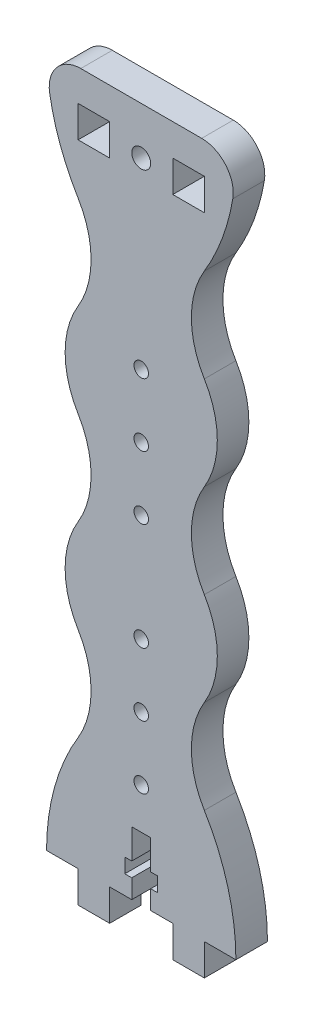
from build123d import *

# Parameters (mm, degrees)
ESQUISSE1_R        = 1.15
ESQUISSE1_R_2      = 1.5
ESQUISSE1_W        = 5
ESQUISSE1_H        = 5
BOSS_EXTRU_1_DEPTH = 5
CONG_1_R           = 5


with BuildPart() as part:
    # Esquisse1 → Boss.-Extru.1 (new body)
    with BuildSketch(Plane.XY):
        with BuildLine():
            Line((5, 0), (0, 0))
            ThreePointArc((0, 0), (1.273224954, 9.340770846), (5, 18))
            ThreePointArc((5, 18), (7.055555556, 25.4), (5, 32.8))
            ThreePointArc((5, 32.8), (2.944444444, 40.2), (5, 47.6))
            ThreePointArc((5, 47.6), (7.055555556, 55), (5, 62.4))
            ThreePointArc((5, 62.4), (2.944444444, 69.8), (5, 77.2))
            ThreePointArc((5, 77.2), (7.055555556, 84.6), (5, 92))
            ThreePointArc((5, 92), (1.273224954, 100.659229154), (0, 110))
            Line((0, 110), (30, 110))
            ThreePointArc((30, 110), (28.726775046, 100.659229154), (25, 92))
            ThreePointArc((25, 92), (22.944444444, 84.6), (25, 77.2))
            ThreePointArc((25, 77.2), (27.055555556, 69.8), (25, 62.4))
            ThreePointArc((25, 62.4), (22.944444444, 55), (25, 47.6))
            ThreePointArc((25, 47.6), (27.055555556, 40.2), (25, 32.8))
            ThreePointArc((25, 32.8), (22.944444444, 25.4), (25, 18))
            ThreePointArc((25, 18), (28.726775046, 9.340770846), (30, 0))
            Line((30, 0), (25, 0))
            Line((25, 0), (25, -5))
            Line((25, -5), (20, -5))
            Line((20, -5), (20, 0))
            Line((20, 0), (16.5, 0))
            Line((16.5, 0), (16.5, 3))
            Line((16.5, 3), (17.6, 3))
            Line((17.6, 3), (17.6, 5.3))
            Line((17.6, 5.3), (16.5, 5.3))
            Line((16.5, 5.3), (16.5, 10))
            Line((16.5, 10), (13.5, 10))
            Line((13.5, 10), (13.5, 5.3))
            Line((13.5, 5.3), (12.4, 5.3))
            Line((12.4, 5.3), (12.4, 3))
            Line((12.4, 3), (13.5, 3))
            Line((13.5, 3), (13.5, 0))
            Line((13.5, 0), (10, 0))
            Line((10, 0), (10, -5))
            Line((10, -5), (5, -5))
            Line((5, -5), (5, 0))
        make_face()
        with Locations((15, 26.5)):
            Circle(ESQUISSE1_R, mode=Mode.SUBTRACT)
        with Locations((15, 63.5)):
            Circle(ESQUISSE1_R, mode=Mode.SUBTRACT)
        with Locations((15, 16.5)):
            Circle(ESQUISSE1_R, mode=Mode.SUBTRACT)
        with Locations((15, 53.5)):
            Circle(ESQUISSE1_R, mode=Mode.SUBTRACT)
        with Locations((15, 73.5)):
            Circle(ESQUISSE1_R, mode=Mode.SUBTRACT)
        with Locations((15, 36.5)):
            Circle(ESQUISSE1_R, mode=Mode.SUBTRACT)
        with Locations((15, 102.5)):
            Circle(ESQUISSE1_R_2, mode=Mode.SUBTRACT)
        with Locations((7.5, 102.5)):
            Rectangle(ESQUISSE1_W, ESQUISSE1_H, mode=Mode.SUBTRACT)
        with Locations((22.5, 102.5)):
            Rectangle(ESQUISSE1_W, ESQUISSE1_H, mode=Mode.SUBTRACT)
    extrude(amount=BOSS_EXTRU_1_DEPTH)

    # Cong_1
    cong_1_edges = [part.edges().sort_by_distance(p)[0] for p in [
        (0, 110, 2.5),
        (30, 110, 2.5),
    ]]
    fillet(cong_1_edges, radius=CONG_1_R)


solid = part.part
